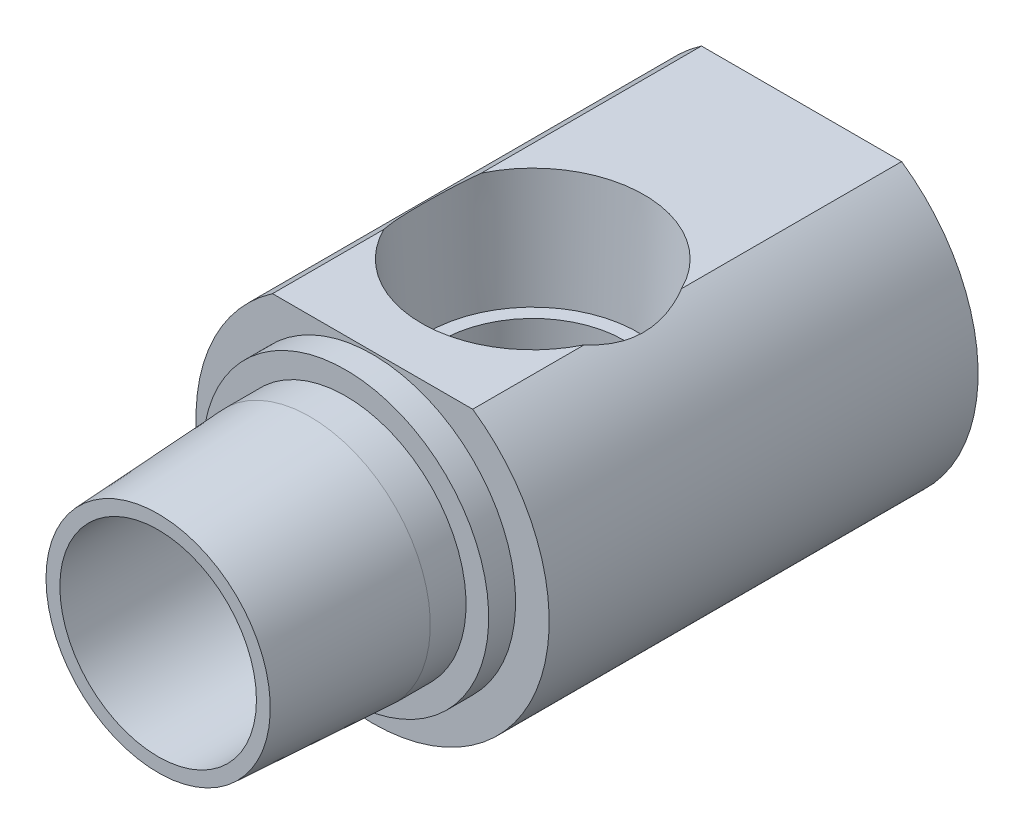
ISO-10303-21;
HEADER;
FILE_DESCRIPTION(('STEP AP214'),'2;1');
FILE_NAME('part.step','',(''),(''),'','','');
FILE_SCHEMA(('AUTOMOTIVE_DESIGN { 1 0 10303 214 1 1 1 1 }'));
ENDSEC;
DATA;
#1=APPLICATION_CONTEXT('core data for automotive mechanical design processes');
#2=APPLICATION_PROTOCOL_DEFINITION('international standard','automotive_design',2000,#1);
#3=PRODUCT_CONTEXT('',#1,'mechanical');
#4=PRODUCT('Part','Part','',(#3));
#5=PRODUCT_RELATED_PRODUCT_CATEGORY('part','',(#4));
#6=PRODUCT_DEFINITION_FORMATION('','',#4);
#7=PRODUCT_DEFINITION_CONTEXT('part definition',#1,'design');
#8=PRODUCT_DEFINITION('design','',#6,#7);
#9=PRODUCT_DEFINITION_SHAPE('','',#8);
#10=(LENGTH_UNIT() NAMED_UNIT(*) SI_UNIT(.MILLI.,.METRE.));
#11=(NAMED_UNIT(*) PLANE_ANGLE_UNIT() SI_UNIT($,.RADIAN.));
#12=(NAMED_UNIT(*) SI_UNIT($,.STERADIAN.) SOLID_ANGLE_UNIT());
#13=UNCERTAINTY_MEASURE_WITH_UNIT(LENGTH_MEASURE(1.E-05),#10,'distance_accuracy_value','');
#14=(GEOMETRIC_REPRESENTATION_CONTEXT(3) GLOBAL_UNCERTAINTY_ASSIGNED_CONTEXT((#13)) GLOBAL_UNIT_ASSIGNED_CONTEXT((#10,
#11,#12)) REPRESENTATION_CONTEXT('',''));
#15=CARTESIAN_POINT('',(0.,0.,0.));
#16=DIRECTION('',(0.,0.,1.));
#17=DIRECTION('',(1.,0.,0.));
#18=AXIS2_PLACEMENT_3D('',#15,#16,#17);
#19=CARTESIAN_POINT('',(-8.89,12.9217429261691,0.));
#20=DIRECTION('',(0.,-1.,0.));
#21=DIRECTION('',(0.,0.,-1.));
#22=AXIS2_PLACEMENT_3D('',#19,#20,#21);
#23=PLANE('',#22);
#24=DIRECTION('',(0.,0.,-1.));
#25=VECTOR('',#24,1.);
#26=CARTESIAN_POINT('',(8.89,12.9217429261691,0.));
#27=LINE('',#26,#25);
#28=CARTESIAN_POINT('',(8.89,12.9217429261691,-19.05));
#29=VERTEX_POINT('',#28);
#30=CARTESIAN_POINT('',(8.89,12.9217429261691,-28.9480549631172));
#31=VERTEX_POINT('',#30);
#32=EDGE_CURVE('E132',#29,#31,#27,.T.);
#33=ORIENTED_EDGE('',*,*,#32,.T.);
#34=CARTESIAN_POINT('',(0.,12.9217429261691,-33.274));
#35=DIRECTION('',(0.,-1.,0.));
#36=DIRECTION('',(0.,0.,-1.));
#37=AXIS2_PLACEMENT_3D('',#34,#35,#36);
#38=CIRCLE('',#37,9.88665264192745);
#39=CARTESIAN_POINT('',(-8.89,12.9217429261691,-28.9480549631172));
#40=VERTEX_POINT('',#39);
#41=EDGE_CURVE('E116',#31,#40,#38,.T.);
#42=ORIENTED_EDGE('',*,*,#41,.T.);
#43=DIRECTION('',(0.,0.,-1.));
#44=VECTOR('',#43,1.);
#45=CARTESIAN_POINT('',(-8.89,12.9217429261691,0.));
#46=LINE('',#45,#44);
#47=CARTESIAN_POINT('',(-8.89,12.9217429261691,-19.05));
#48=VERTEX_POINT('',#47);
#49=EDGE_CURVE('E142',#48,#40,#46,.T.);
#50=ORIENTED_EDGE('',*,*,#49,.F.);
#51=DIRECTION('',(1.,0.,0.));
#52=VECTOR('',#51,1.);
#53=CARTESIAN_POINT('',(-12.7,12.9217429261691,-19.05));
#54=LINE('',#53,#52);
#55=EDGE_CURVE('E139',#48,#29,#54,.T.);
#56=ORIENTED_EDGE('',*,*,#55,.T.);
#57=EDGE_LOOP('',(#33,#42,#50,#56));
#58=FACE_BOUND('',#57,.T.);
#59=ADVANCED_FACE('F16',(#58),#23,.F.);
#60=CARTESIAN_POINT('',(-8.73125000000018,0.,-17.0777962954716));
#61=DIRECTION('',(0.,0.,1.));
#62=DIRECTION('',(1.,0.,0.));
#63=AXIS2_PLACEMENT_3D('',#60,#61,#62);
#64=PLANE('',#63);
#65=CARTESIAN_POINT('',(0.,0.,-17.0777962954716));
#66=DIRECTION('',(0.,0.,-1.));
#67=DIRECTION('',(-1.,0.,0.));
#68=AXIS2_PLACEMENT_3D('',#65,#66,#67);
#69=CIRCLE('',#68,8.73125000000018);
#70=CARTESIAN_POINT('',(-8.73125000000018,0.,-17.0777962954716));
#71=VERTEX_POINT('',#70);
#72=EDGE_CURVE('E164',#71,#71,#69,.T.);
#73=ORIENTED_EDGE('',*,*,#72,.F.);
#74=EDGE_LOOP('',(#73));
#75=FACE_BOUND('',#74,.T.);
#76=CARTESIAN_POINT('',(0.,-1.53831558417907,-17.0777962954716));
#77=DIRECTION('',(0.,0.,1.));
#78=DIRECTION('',(0.,1.,0.));
#79=AXIS2_PLACEMENT_3D('',#76,#77,#78);
#80=ELLIPSE('',#79,7.0682508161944,6.80767250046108);
#81=CARTESIAN_POINT('',(0.,5.52993523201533,-17.0777962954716));
#82=VERTEX_POINT('',#81);
#83=EDGE_CURVE('E175',#82,#82,#80,.F.);
#84=ORIENTED_EDGE('',*,*,#83,.T.);
#85=EDGE_LOOP('',(#84));
#86=FACE_BOUND('',#85,.T.);
#87=ADVANCED_FACE('F220',(#75,#86),#64,.T.);
#88=CARTESIAN_POINT('',(0.,0.,-13.4874));
#89=DIRECTION('',(0.,0.,-1.));
#90=DIRECTION('',(-1.,0.,0.));
#91=AXIS2_PLACEMENT_3D('',#88,#89,#90);
#92=CONICAL_SURFACE('',#91,10.6883167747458,0.0538619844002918);
#93=CARTESIAN_POINT('',(0.,0.,0.));
#94=DIRECTION('',(0.,0.,-1.));
#95=DIRECTION('',(-1.,0.,0.));
#96=AXIS2_PLACEMENT_3D('',#93,#94,#95);
#97=CIRCLE('',#96,9.96115531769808);
#98=CARTESIAN_POINT('',(-9.96115531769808,0.,0.));
#99=VERTEX_POINT('',#98);
#100=EDGE_CURVE('E170',#99,#99,#97,.T.);
#101=ORIENTED_EDGE('',*,*,#100,.T.);
#102=EDGE_LOOP('',(#101));
#103=FACE_BOUND('',#102,.T.);
#104=CARTESIAN_POINT('',(0.,0.,-13.4874));
#105=DIRECTION('',(0.,0.,-1.));
#106=DIRECTION('',(-1.,0.,0.));
#107=AXIS2_PLACEMENT_3D('',#104,#105,#106);
#108=CIRCLE('',#107,10.6883167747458);
#109=CARTESIAN_POINT('',(-10.6883167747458,0.,-13.4874));
#110=VERTEX_POINT('',#109);
#111=EDGE_CURVE('E147',#110,#110,#108,.T.);
#112=ORIENTED_EDGE('',*,*,#111,.F.);
#113=EDGE_LOOP('',(#112));
#114=FACE_BOUND('',#113,.T.);
#115=ADVANCED_FACE('F18',(#103,#114),#92,.T.);
#116=CARTESIAN_POINT('',(-8.73125000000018,0.,0.));
#117=DIRECTION('',(0.,0.,1.));
#118=DIRECTION('',(1.,0.,0.));
#119=AXIS2_PLACEMENT_3D('',#116,#117,#118);
#120=PLANE('',#119);
#121=CARTESIAN_POINT('',(0.,0.,0.));
#122=DIRECTION('',(0.,0.,-1.));
#123=DIRECTION('',(-1.,0.,0.));
#124=AXIS2_PLACEMENT_3D('',#121,#122,#123);
#125=CIRCLE('',#124,8.73125000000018);
#126=CARTESIAN_POINT('',(-8.73125000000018,0.,0.));
#127=VERTEX_POINT('',#126);
#128=EDGE_CURVE('E167',#127,#127,#125,.T.);
#129=ORIENTED_EDGE('',*,*,#128,.T.);
#130=EDGE_LOOP('',(#129));
#131=FACE_BOUND('',#130,.T.);
#132=ORIENTED_EDGE('',*,*,#100,.F.);
#133=EDGE_LOOP('',(#132));
#134=FACE_BOUND('',#133,.T.);
#135=ADVANCED_FACE('F225',(#131,#134),#120,.T.);
#136=CARTESIAN_POINT('',(0.,0.,-75.1971669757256));
#137=DIRECTION('',(0.,0.,-1.));
#138=DIRECTION('',(-1.,0.,0.));
#139=AXIS2_PLACEMENT_3D('',#136,#137,#138);
#140=CYLINDRICAL_SURFACE('',#139,8.73125000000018);
#141=ORIENTED_EDGE('',*,*,#72,.T.);
#142=EDGE_LOOP('',(#141));
#143=FACE_BOUND('',#142,.T.);
#144=ORIENTED_EDGE('',*,*,#128,.F.);
#145=EDGE_LOOP('',(#144));
#146=FACE_BOUND('',#145,.T.);
#147=ADVANCED_FACE('F218',(#143,#146),#140,.F.);
#148=CARTESIAN_POINT('',(-15.6845,0.,-57.15));
#149=DIRECTION('',(0.,0.,-1.));
#150=DIRECTION('',(-1.,0.,0.));
#151=AXIS2_PLACEMENT_3D('',#148,#149,#150);
#152=PLANE('',#151);
#153=DIRECTION('',(1.,0.,0.));
#154=VECTOR('',#153,1.);
#155=CARTESIAN_POINT('',(-3.66617420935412,6.35,-57.15));
#156=LINE('',#155,#154);
#157=CARTESIAN_POINT('',(-3.66617420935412,6.35,-57.15));
#158=VERTEX_POINT('',#157);
#159=CARTESIAN_POINT('',(3.66617420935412,6.35,-57.15));
#160=VERTEX_POINT('',#159);
#161=EDGE_CURVE('E178',#158,#160,#156,.T.);
#162=ORIENTED_EDGE('',*,*,#161,.F.);
#163=DIRECTION('',(0.5,0.866025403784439,0.));
#164=VECTOR('',#163,1.);
#165=CARTESIAN_POINT('',(-7.33234841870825,0.,-57.15));
#166=LINE('',#165,#164);
#167=CARTESIAN_POINT('',(-7.33234841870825,0.,-57.15));
#168=VERTEX_POINT('',#167);
#169=EDGE_CURVE('E435',#168,#158,#166,.T.);
#170=ORIENTED_EDGE('',*,*,#169,.F.);
#171=DIRECTION('',(-0.5,0.866025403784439,0.));
#172=VECTOR('',#171,1.);
#173=CARTESIAN_POINT('',(-3.66617420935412,-6.35,-57.15));
#174=LINE('',#173,#172);
#175=CARTESIAN_POINT('',(-3.66617420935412,-6.35,-57.15));
#176=VERTEX_POINT('',#175);
#177=EDGE_CURVE('E461',#176,#168,#174,.T.);
#178=ORIENTED_EDGE('',*,*,#177,.F.);
#179=DIRECTION('',(-1.,0.,0.));
#180=VECTOR('',#179,1.);
#181=CARTESIAN_POINT('',(3.66617420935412,-6.35,-57.15));
#182=LINE('',#181,#180);
#183=CARTESIAN_POINT('',(3.66617420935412,-6.35,-57.15));
#184=VERTEX_POINT('',#183);
#185=EDGE_CURVE('E458',#184,#176,#182,.T.);
#186=ORIENTED_EDGE('',*,*,#185,.F.);
#187=DIRECTION('',(-0.5,-0.866025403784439,0.));
#188=VECTOR('',#187,1.);
#189=CARTESIAN_POINT('',(7.33234841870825,0.,-57.15));
#190=LINE('',#189,#188);
#191=CARTESIAN_POINT('',(7.33234841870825,0.,-57.15));
#192=VERTEX_POINT('',#191);
#193=EDGE_CURVE('E455',#192,#184,#190,.T.);
#194=ORIENTED_EDGE('',*,*,#193,.F.);
#195=DIRECTION('',(0.5,-0.866025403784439,0.));
#196=VECTOR('',#195,1.);
#197=CARTESIAN_POINT('',(3.66617420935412,6.35,-57.15));
#198=LINE('',#197,#196);
#199=EDGE_CURVE('E452',#160,#192,#198,.T.);
#200=ORIENTED_EDGE('',*,*,#199,.F.);
#201=EDGE_LOOP('',(#162,#170,#178,#186,#194,#200));
#202=FACE_BOUND('',#201,.T.);
#203=DIRECTION('',(-1.,0.,0.));
#204=VECTOR('',#203,1.);
#205=CARTESIAN_POINT('',(-8.89,12.9217429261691,-57.15));
#206=LINE('',#205,#204);
#207=CARTESIAN_POINT('',(8.89,12.9217429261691,-57.15));
#208=VERTEX_POINT('',#207);
#209=CARTESIAN_POINT('',(-8.89,12.9217429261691,-57.15));
#210=VERTEX_POINT('',#209);
#211=EDGE_CURVE('E144',#208,#210,#206,.T.);
#212=ORIENTED_EDGE('',*,*,#211,.F.);
#213=CARTESIAN_POINT('',(0.,0.,-57.15));
#214=DIRECTION('',(0.,0.,-1.));
#215=DIRECTION('',(-1.,0.,0.));
#216=AXIS2_PLACEMENT_3D('',#213,#214,#215);
#217=CIRCLE('',#216,15.6845);
#218=EDGE_CURVE('E161',#208,#210,#217,.T.);
#219=ORIENTED_EDGE('',*,*,#218,.T.);
#220=EDGE_LOOP('',(#212,#219));
#221=FACE_BOUND('',#220,.T.);
#222=ADVANCED_FACE('F213',(#202,#221),#152,.T.);
#223=CARTESIAN_POINT('',(0.,0.,-75.1971669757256));
#224=DIRECTION('',(0.,0.,-1.));
#225=DIRECTION('',(-1.,0.,0.));
#226=AXIS2_PLACEMENT_3D('',#223,#224,#225);
#227=CYLINDRICAL_SURFACE('',#226,15.6845);
#228=CARTESIAN_POINT('',(6.18126199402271,14.4151149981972,-25.4578903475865));
#229=CARTESIAN_POINT('',(6.40820210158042,14.317827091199,-25.6438923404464));
#230=CARTESIAN_POINT('',(6.62617183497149,14.2179923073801,-25.8394298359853));
#231=CARTESIAN_POINT('',(7.04356392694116,14.015896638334,-26.248561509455));
#232=CARTESIAN_POINT('',(7.24297338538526,13.9136341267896,-26.4621680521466));
#233=CARTESIAN_POINT('',(7.62085258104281,13.7102837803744,-26.9044425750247));
#234=CARTESIAN_POINT('',(7.79947267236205,13.6091929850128,-27.1329809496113));
#235=CARTESIAN_POINT('',(8.13667540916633,13.4103063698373,-27.605534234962));
#236=CARTESIAN_POINT('',(8.29527210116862,13.3125082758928,-27.8495381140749));
#237=CARTESIAN_POINT('',(8.52405372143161,13.166366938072,-28.237604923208));
#238=CARTESIAN_POINT('',(8.6015950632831,13.1157948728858,-28.3765443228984));
#239=CARTESIAN_POINT('',(8.75042416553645,13.0169736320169,-28.6587897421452));
#240=CARTESIAN_POINT('',(8.82170394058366,12.9687274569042,-28.8021010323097));
#241=CARTESIAN_POINT('',(8.98942344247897,12.85334420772,-29.160530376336));
#242=CARTESIAN_POINT('',(9.082097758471,12.7878879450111,-29.377972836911));
#243=CARTESIAN_POINT('',(9.25265845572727,12.6650269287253,-29.8207919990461));
#244=CARTESIAN_POINT('',(9.33054529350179,12.6076219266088,-30.046168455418));
#245=CARTESIAN_POINT('',(9.47086217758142,12.5025600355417,-30.5041364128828));
#246=CARTESIAN_POINT('',(9.5332799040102,12.4549109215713,-30.7367334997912));
#247=CARTESIAN_POINT('',(9.64181076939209,12.3710847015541,-31.2076218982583));
#248=CARTESIAN_POINT('',(9.68793245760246,12.3349015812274,-31.445910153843));
#249=CARTESIAN_POINT('',(9.76349281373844,12.2751820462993,-31.9282043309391));
#250=CARTESIAN_POINT('',(9.79282896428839,12.2517233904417,-32.1722361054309));
#251=CARTESIAN_POINT('',(9.83390591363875,12.2187780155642,-32.662731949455));
#252=CARTESIAN_POINT('',(9.84564637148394,12.2092915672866,-32.9091960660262));
#253=CARTESIAN_POINT('',(9.85132494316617,12.2047101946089,-33.4024609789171));
#254=CARTESIAN_POINT('',(9.84526326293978,12.2096151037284,-33.6492617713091));
#255=CARTESIAN_POINT('',(9.81544491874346,12.233598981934,-34.1410778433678));
#256=CARTESIAN_POINT('',(9.79168936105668,12.2526770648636,-34.386093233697));
#257=CARTESIAN_POINT('',(9.7294701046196,12.3021291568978,-34.8530070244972));
#258=CARTESIAN_POINT('',(9.69232783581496,12.3314830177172,-35.0751929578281));
#259=CARTESIAN_POINT('',(9.60385268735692,12.400512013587,-35.5151815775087));
#260=CARTESIAN_POINT('',(9.55251354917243,12.4401917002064,-35.7329822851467));
#261=CARTESIAN_POINT('',(9.43631194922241,12.5285621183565,-36.1626605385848));
#262=CARTESIAN_POINT('',(9.37147123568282,12.5772383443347,-36.3745469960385));
#263=CARTESIAN_POINT('',(9.22879623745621,12.6822986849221,-36.7919366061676));
#264=CARTESIAN_POINT('',(9.15096192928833,12.7386828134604,-36.9974397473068));
#265=CARTESIAN_POINT('',(9.01061877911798,12.838109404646,-37.3347261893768));
#266=CARTESIAN_POINT('',(8.95152353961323,12.8794177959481,-37.4684665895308));
#267=CARTESIAN_POINT('',(8.76461266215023,13.0080031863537,-37.8679033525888));
#268=CARTESIAN_POINT('',(8.62838014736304,13.0990466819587,-38.1285210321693));
#269=CARTESIAN_POINT('',(8.33484719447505,13.2877507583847,-38.6351224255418));
#270=CARTESIAN_POINT('',(8.17753852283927,13.3854139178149,-38.8811003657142));
#271=CARTESIAN_POINT('',(7.8423843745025,13.5844995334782,-39.3580815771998));
#272=CARTESIAN_POINT('',(7.66448703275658,13.685931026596,-39.5890446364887));
#273=CARTESIAN_POINT('',(7.28939666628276,13.8893391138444,-40.034214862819));
#274=CARTESIAN_POINT('',(7.09221474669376,13.9913153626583,-40.2484315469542));
#275=CARTESIAN_POINT('',(6.68803601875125,14.1888008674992,-40.6503950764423));
#276=CARTESIAN_POINT('',(6.48182024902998,14.2844001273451,-40.8388823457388));
#277=CARTESIAN_POINT('',(6.05384699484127,14.4709681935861,-41.1977896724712));
#278=CARTESIAN_POINT('',(5.83215453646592,14.5619538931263,-41.3682785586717));
#279=CARTESIAN_POINT('',(5.60267382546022,14.6496957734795,-41.529590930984));
#280=B_SPLINE_CURVE_WITH_KNOTS('',3,(#228,#229,#230,#231,#232,#233,#234,#235,#236,#237,#238,
#239,#240,#241,#242,#243,#244,#245,#246,#247,#248,#249,#250,#251,#252,#253,#254,#255,#256,#257,
#258,#259,#260,#261,#262,#263,#264,#265,#266,#267,#268,#269,#270,#271,#272,#273,#274,#275,#276,
#277,#278,#279),.UNSPECIFIED.,.F.,.F.,(4,2,2,2,2,2,2,2,2,2,2,2,2,2,2,2,2,2,2,2,2,2,2,2,2,4),(0.,
0.927053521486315,1.85474664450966,2.77524763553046,3.69509925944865,4.19580328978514,
4.69713686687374,5.43222687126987,6.16729417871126,6.90294503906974,7.63820938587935,
8.37791768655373,9.11764032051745,9.85735439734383,10.5970222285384,11.2778067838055,
11.9588919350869,12.6388883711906,13.3188860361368,13.7745816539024,14.6967959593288,
15.6193715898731,16.5443240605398,17.4687469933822,18.3536130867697,19.2349623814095),.UNSPECIFIED.);
#281=CARTESIAN_POINT('',(8.89,12.9217429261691,-37.5999450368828));
#282=VERTEX_POINT('',#281);
#283=EDGE_CURVE('E36',#31,#282,#280,.T.);
#284=ORIENTED_EDGE('',*,*,#283,.F.);
#285=ORIENTED_EDGE('',*,*,#32,.F.);
#286=CARTESIAN_POINT('',(0.,0.,-19.05));
#287=DIRECTION('',(0.,0.,-1.));
#288=DIRECTION('',(-1.,0.,0.));
#289=AXIS2_PLACEMENT_3D('',#286,#287,#288);
#290=CIRCLE('',#289,15.6845);
#291=EDGE_CURVE('E159',#29,#48,#290,.T.);
#292=ORIENTED_EDGE('',*,*,#291,.T.);
#293=ORIENTED_EDGE('',*,*,#49,.T.);
#294=CARTESIAN_POINT('',(-5.60267382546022,14.6496957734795,-41.529590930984));
#295=CARTESIAN_POINT('',(-5.83916916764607,14.5592741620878,-41.3633464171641));
#296=CARTESIAN_POINT('',(-6.06739391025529,14.4654038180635,-41.1873565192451));
#297=CARTESIAN_POINT('',(-6.50657666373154,14.2732361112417,-40.8171061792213));
#298=CARTESIAN_POINT('',(-6.71753229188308,14.1749381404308,-40.6228432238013));
#299=CARTESIAN_POINT('',(-7.12045557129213,13.9768691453,-40.21824748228));
#300=CARTESIAN_POINT('',(-7.31250621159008,13.8771069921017,-40.0079928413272));
#301=CARTESIAN_POINT('',(-7.67797599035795,13.6782845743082,-39.5717033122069));
#302=CARTESIAN_POINT('',(-7.85140185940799,13.5792240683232,-39.3456741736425));
#303=CARTESIAN_POINT('',(-8.18139016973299,13.3830412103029,-38.8751731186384));
#304=CARTESIAN_POINT('',(-8.33766306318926,13.2859696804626,-38.6304767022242));
#305=CARTESIAN_POINT('',(-8.62954581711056,13.0982677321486,-38.1262921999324));
#306=CARTESIAN_POINT('',(-8.76513502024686,13.0076438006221,-37.8667896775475));
#307=CARTESIAN_POINT('',(-8.98947377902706,12.8533099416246,-37.387363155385));
#308=CARTESIAN_POINT('',(-9.0821738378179,12.7878343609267,-37.1698495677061));
#309=CARTESIAN_POINT('',(-9.25276992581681,12.6649454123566,-36.726898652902));
#310=CARTESIAN_POINT('',(-9.33066889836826,12.6075304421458,-36.501462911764));
#311=CARTESIAN_POINT('',(-9.47096094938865,12.5024850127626,-36.043506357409));
#312=CARTESIAN_POINT('',(-9.53335030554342,12.4548569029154,-35.81098385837));
#313=CARTESIAN_POINT('',(-9.64183755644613,12.3710636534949,-35.3402390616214));
#314=CARTESIAN_POINT('',(-9.68794342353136,12.3348929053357,-35.1020196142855));
#315=CARTESIAN_POINT('',(-9.76349062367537,12.2751837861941,-34.6198098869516));
#316=CARTESIAN_POINT('',(-9.79282550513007,12.2517261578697,-34.3757927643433));
#317=CARTESIAN_POINT('',(-9.83390185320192,12.2187812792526,-33.8853289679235));
#318=CARTESIAN_POINT('',(-9.84564316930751,12.2092941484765,-33.6388822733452));
#319=CARTESIAN_POINT('',(-9.85132631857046,12.2047090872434,-33.1456193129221));
#320=CARTESIAN_POINT('',(-9.84526600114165,12.2096128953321,-32.8988030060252));
#321=CARTESIAN_POINT('',(-9.81544809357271,12.2335964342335,-32.4069549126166));
#322=CARTESIAN_POINT('',(-9.79169153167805,12.2526753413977,-32.1619230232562));
#323=CARTESIAN_POINT('',(-9.72947134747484,12.3021281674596,-31.6950023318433));
#324=CARTESIAN_POINT('',(-9.69233092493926,12.3314805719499,-31.4728256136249));
#325=CARTESIAN_POINT('',(-9.60386128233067,12.4005053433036,-31.0328579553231));
#326=CARTESIAN_POINT('',(-9.55252598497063,12.4401821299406,-30.8150689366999));
#327=CARTESIAN_POINT('',(-9.43632738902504,12.5285504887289,-30.3853913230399));
#328=CARTESIAN_POINT('',(-9.37148448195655,12.5772284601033,-30.1734943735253));
#329=CARTESIAN_POINT('',(-9.22880457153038,12.6822926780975,-29.7560851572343));
#330=CARTESIAN_POINT('',(-9.1509674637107,12.7386789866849,-29.5505729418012));
#331=CARTESIAN_POINT('',(-9.01061796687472,12.8381099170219,-29.2132722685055));
#332=CARTESIAN_POINT('',(-8.95152097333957,12.8794194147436,-29.0795285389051));
#333=CARTESIAN_POINT('',(-8.80068775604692,12.9831855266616,-28.7571898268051));
#334=CARTESIAN_POINT('',(-8.70603543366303,13.0469462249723,-28.5703660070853));
#335=CARTESIAN_POINT('',(-8.50583150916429,13.1783430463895,-28.2038453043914));
#336=CARTESIAN_POINT('',(-8.40026939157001,13.2459828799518,-28.0241555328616));
#337=CARTESIAN_POINT('',(-8.14693598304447,13.403699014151,-27.6220187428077));
#338=CARTESIAN_POINT('',(-7.99573471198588,13.4946529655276,-27.402065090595));
#339=CARTESIAN_POINT('',(-7.67663330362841,13.6786987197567,-26.9754150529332));
#340=CARTESIAN_POINT('',(-7.50872479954,13.7717915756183,-26.7687253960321));
#341=CARTESIAN_POINT('',(-7.15655125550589,13.9580450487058,-26.3691064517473));
#342=CARTESIAN_POINT('',(-6.97225920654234,14.0512055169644,-26.176200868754));
#343=CARTESIAN_POINT('',(-6.5882203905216,14.2353204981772,-25.8055123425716));
#344=CARTESIAN_POINT('',(-6.38848080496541,14.3262760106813,-25.6277224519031));
#345=CARTESIAN_POINT('',(-6.18126199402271,14.4151149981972,-25.4578903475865));
#346=B_SPLINE_CURVE_WITH_KNOTS('',3,(#294,#295,#296,#297,#298,#299,#300,#301,#302,#303,#304,
#305,#306,#307,#308,#309,#310,#311,#312,#313,#314,#315,#316,#317,#318,#319,#320,#321,#322,#323,
#324,#325,#326,#327,#328,#329,#330,#331,#332,#333,#334,#335,#336,#337,#338,#339,#340,#341,#342,
#343,#344,#345),.UNSPECIFIED.,.F.,.F.,(4,2,2,2,2,2,2,2,2,2,2,2,2,2,2,2,2,2,2,2,2,2,2,2,2,4),(0.,
0.908274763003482,1.81667463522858,2.7208901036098,3.62477770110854,4.54212421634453,
5.46038099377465,6.19576092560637,6.93099446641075,7.66640429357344,8.40145356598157,
9.14111809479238,9.88078895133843,10.6205491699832,11.3602664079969,12.0410224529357,
12.7220704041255,13.4020975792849,14.0821302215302,14.5378258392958,15.1941212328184,
15.8510552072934,16.6961350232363,17.5416401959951,18.388566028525,19.2351004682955),.UNSPECIFIED.);
#347=CARTESIAN_POINT('',(-8.89,12.9217429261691,-37.5999450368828));
#348=VERTEX_POINT('',#347);
#349=EDGE_CURVE('E120',#348,#40,#346,.T.);
#350=ORIENTED_EDGE('',*,*,#349,.F.);
#351=EDGE_CURVE('E140',#348,#210,#46,.T.);
#352=ORIENTED_EDGE('',*,*,#351,.T.);
#353=ORIENTED_EDGE('',*,*,#218,.F.);
#354=EDGE_CURVE('E135',#282,#208,#27,.T.);
#355=ORIENTED_EDGE('',*,*,#354,.F.);
#356=EDGE_LOOP('',(#284,#285,#292,#293,#350,#352,#353,#355));
#357=FACE_BOUND('',#356,.T.);
#358=ADVANCED_FACE('F130',(#357),#227,.T.);
#359=CARTESIAN_POINT('',(-12.7,0.,-19.05));
#360=DIRECTION('',(0.,0.,1.));
#361=DIRECTION('',(1.,0.,0.));
#362=AXIS2_PLACEMENT_3D('',#359,#360,#361);
#363=PLANE('',#362);
#364=ORIENTED_EDGE('',*,*,#55,.F.);
#365=ORIENTED_EDGE('',*,*,#291,.F.);
#366=EDGE_LOOP('',(#364,#365));
#367=FACE_BOUND('',#366,.T.);
#368=CARTESIAN_POINT('',(0.,0.,-19.05));
#369=DIRECTION('',(0.,0.,-1.));
#370=DIRECTION('',(-1.,0.,0.));
#371=AXIS2_PLACEMENT_3D('',#368,#369,#370);
#372=CIRCLE('',#371,12.7);
#373=CARTESIAN_POINT('',(-12.7,0.,-19.05));
#374=VERTEX_POINT('',#373);
#375=EDGE_CURVE('E156',#374,#374,#372,.T.);
#376=ORIENTED_EDGE('',*,*,#375,.T.);
#377=EDGE_LOOP('',(#376));
#378=FACE_BOUND('',#377,.T.);
#379=ADVANCED_FACE('F212',(#367,#378),#363,.T.);
#380=CARTESIAN_POINT('',(0.,0.,-75.1971669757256));
#381=DIRECTION('',(0.,0.,-1.));
#382=DIRECTION('',(-1.,0.,0.));
#383=AXIS2_PLACEMENT_3D('',#380,#381,#382);
#384=CYLINDRICAL_SURFACE('',#383,12.7);
#385=CARTESIAN_POINT('',(0.,0.,-16.6624));
#386=DIRECTION('',(0.,0.,-1.));
#387=DIRECTION('',(-1.,0.,0.));
#388=AXIS2_PLACEMENT_3D('',#385,#386,#387);
#389=CIRCLE('',#388,12.7);
#390=CARTESIAN_POINT('',(-12.7,0.,-16.6624));
#391=VERTEX_POINT('',#390);
#392=EDGE_CURVE('E153',#391,#391,#389,.T.);
#393=ORIENTED_EDGE('',*,*,#392,.T.);
#394=EDGE_LOOP('',(#393));
#395=FACE_BOUND('',#394,.T.);
#396=ORIENTED_EDGE('',*,*,#375,.F.);
#397=EDGE_LOOP('',(#396));
#398=FACE_BOUND('',#397,.T.);
#399=ADVANCED_FACE('F263',(#395,#398),#384,.T.);
#400=CARTESIAN_POINT('',(-10.6883167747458,0.,-16.6624));
#401=DIRECTION('',(0.,0.,1.));
#402=DIRECTION('',(1.,0.,0.));
#403=AXIS2_PLACEMENT_3D('',#400,#401,#402);
#404=PLANE('',#403);
#405=CARTESIAN_POINT('',(0.,0.,-16.6624));
#406=DIRECTION('',(0.,0.,-1.));
#407=DIRECTION('',(-1.,0.,0.));
#408=AXIS2_PLACEMENT_3D('',#405,#406,#407);
#409=CIRCLE('',#408,10.6883167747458);
#410=CARTESIAN_POINT('',(-10.6883167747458,0.,-16.6624));
#411=VERTEX_POINT('',#410);
#412=EDGE_CURVE('E150',#411,#411,#409,.T.);
#413=ORIENTED_EDGE('',*,*,#412,.T.);
#414=EDGE_LOOP('',(#413));
#415=FACE_BOUND('',#414,.T.);
#416=ORIENTED_EDGE('',*,*,#392,.F.);
#417=EDGE_LOOP('',(#416));
#418=FACE_BOUND('',#417,.T.);
#419=ADVANCED_FACE('F255',(#415,#418),#404,.T.);
#420=CARTESIAN_POINT('',(0.,0.,-75.1971669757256));
#421=DIRECTION('',(0.,0.,-1.));
#422=DIRECTION('',(-1.,0.,0.));
#423=AXIS2_PLACEMENT_3D('',#420,#421,#422);
#424=CYLINDRICAL_SURFACE('',#423,10.6883167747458);
#425=ORIENTED_EDGE('',*,*,#111,.T.);
#426=EDGE_LOOP('',(#425));
#427=FACE_BOUND('',#426,.T.);
#428=ORIENTED_EDGE('',*,*,#412,.F.);
#429=EDGE_LOOP('',(#428));
#430=FACE_BOUND('',#429,.T.);
#431=ADVANCED_FACE('F246',(#427,#430),#424,.T.);
#432=ORIENTED_EDGE('',*,*,#351,.F.);
#433=EDGE_CURVE('E125',#348,#282,#38,.T.);
#434=ORIENTED_EDGE('',*,*,#433,.T.);
#435=ORIENTED_EDGE('',*,*,#354,.T.);
#436=ORIENTED_EDGE('',*,*,#211,.T.);
#437=EDGE_LOOP('',(#432,#434,#435,#436));
#438=FACE_BOUND('',#437,.T.);
#439=ADVANCED_FACE('F238',(#438),#23,.F.);
#440=CARTESIAN_POINT('',(-3.66617420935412,6.35,-50.8));
#441=DIRECTION('',(0.,1.,0.));
#442=DIRECTION('',(-1.,0.,0.));
#443=AXIS2_PLACEMENT_3D('',#440,#441,#442);
#444=PLANE('',#443);
#445=ORIENTED_EDGE('',*,*,#161,.T.);
#446=DIRECTION('',(0.,0.,-1.));
#447=VECTOR('',#446,1.);
#448=CARTESIAN_POINT('',(3.66617420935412,6.35,-50.8));
#449=LINE('',#448,#447);
#450=CARTESIAN_POINT('',(3.66617420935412,6.35,-50.8));
#451=VERTEX_POINT('',#450);
#452=EDGE_CURVE('E450',#451,#160,#449,.T.);
#453=ORIENTED_EDGE('',*,*,#452,.F.);
#454=DIRECTION('',(1.,0.,0.));
#455=VECTOR('',#454,1.);
#456=CARTESIAN_POINT('',(-3.66617420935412,6.35,-50.8));
#457=LINE('',#456,#455);
#458=CARTESIAN_POINT('',(-3.66617420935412,6.35,-50.8));
#459=VERTEX_POINT('',#458);
#460=EDGE_CURVE('E431',#459,#451,#457,.T.);
#461=ORIENTED_EDGE('',*,*,#460,.F.);
#462=DIRECTION('',(0.,0.,-1.));
#463=VECTOR('',#462,1.);
#464=CARTESIAN_POINT('',(-3.66617420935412,6.35,-50.8));
#465=LINE('',#464,#463);
#466=EDGE_CURVE('E466',#459,#158,#465,.T.);
#467=ORIENTED_EDGE('',*,*,#466,.T.);
#468=EDGE_LOOP('',(#445,#453,#461,#467));
#469=FACE_BOUND('',#468,.T.);
#470=ADVANCED_FACE('F245',(#469),#444,.F.);
#471=CARTESIAN_POINT('',(-7.33234841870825,0.,-50.8));
#472=DIRECTION('',(-0.866025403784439,0.5,0.));
#473=DIRECTION('',(-0.5,-0.866025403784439,0.));
#474=AXIS2_PLACEMENT_3D('',#471,#472,#473);
#475=PLANE('',#474);
#476=ORIENTED_EDGE('',*,*,#169,.T.);
#477=ORIENTED_EDGE('',*,*,#466,.F.);
#478=DIRECTION('',(0.5,0.866025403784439,0.));
#479=VECTOR('',#478,1.);
#480=CARTESIAN_POINT('',(-7.33234841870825,0.,-50.8));
#481=LINE('',#480,#479);
#482=CARTESIAN_POINT('',(-7.33234841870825,0.,-50.8));
#483=VERTEX_POINT('',#482);
#484=EDGE_CURVE('E447',#483,#459,#481,.T.);
#485=ORIENTED_EDGE('',*,*,#484,.F.);
#486=DIRECTION('',(0.,0.,-1.));
#487=VECTOR('',#486,1.);
#488=CARTESIAN_POINT('',(-7.33234841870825,0.,-50.8));
#489=LINE('',#488,#487);
#490=EDGE_CURVE('E468',#483,#168,#489,.T.);
#491=ORIENTED_EDGE('',*,*,#490,.T.);
#492=EDGE_LOOP('',(#476,#477,#485,#491));
#493=FACE_BOUND('',#492,.T.);
#494=ADVANCED_FACE('F253',(#493),#475,.F.);
#495=CARTESIAN_POINT('',(-3.66617420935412,-6.35,-50.8));
#496=DIRECTION('',(-0.866025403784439,-0.5,0.));
#497=DIRECTION('',(0.5,-0.866025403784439,0.));
#498=AXIS2_PLACEMENT_3D('',#495,#496,#497);
#499=PLANE('',#498);
#500=ORIENTED_EDGE('',*,*,#177,.T.);
#501=ORIENTED_EDGE('',*,*,#490,.F.);
#502=DIRECTION('',(-0.5,0.866025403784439,0.));
#503=VECTOR('',#502,1.);
#504=CARTESIAN_POINT('',(-3.66617420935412,-6.35,-50.8));
#505=LINE('',#504,#503);
#506=CARTESIAN_POINT('',(-3.66617420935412,-6.35,-50.8));
#507=VERTEX_POINT('',#506);
#508=EDGE_CURVE('E444',#507,#483,#505,.T.);
#509=ORIENTED_EDGE('',*,*,#508,.F.);
#510=DIRECTION('',(0.,0.,-1.));
#511=VECTOR('',#510,1.);
#512=CARTESIAN_POINT('',(-3.66617420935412,-6.35,-50.8));
#513=LINE('',#512,#511);
#514=EDGE_CURVE('E470',#507,#176,#513,.T.);
#515=ORIENTED_EDGE('',*,*,#514,.T.);
#516=EDGE_LOOP('',(#500,#501,#509,#515));
#517=FACE_BOUND('',#516,.T.);
#518=ADVANCED_FACE('F335',(#517),#499,.F.);
#519=CARTESIAN_POINT('',(3.66617420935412,-6.35,-50.8));
#520=DIRECTION('',(0.,-1.,0.));
#521=DIRECTION('',(1.,0.,0.));
#522=AXIS2_PLACEMENT_3D('',#519,#520,#521);
#523=PLANE('',#522);
#524=ORIENTED_EDGE('',*,*,#185,.T.);
#525=ORIENTED_EDGE('',*,*,#514,.F.);
#526=DIRECTION('',(-1.,0.,0.));
#527=VECTOR('',#526,1.);
#528=CARTESIAN_POINT('',(3.66617420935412,-6.35,-50.8));
#529=LINE('',#528,#527);
#530=CARTESIAN_POINT('',(3.66617420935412,-6.35,-50.8));
#531=VERTEX_POINT('',#530);
#532=EDGE_CURVE('E441',#531,#507,#529,.T.);
#533=ORIENTED_EDGE('',*,*,#532,.F.);
#534=DIRECTION('',(0.,0.,-1.));
#535=VECTOR('',#534,1.);
#536=CARTESIAN_POINT('',(3.66617420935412,-6.35,-50.8));
#537=LINE('',#536,#535);
#538=EDGE_CURVE('E472',#531,#184,#537,.T.);
#539=ORIENTED_EDGE('',*,*,#538,.T.);
#540=EDGE_LOOP('',(#524,#525,#533,#539));
#541=FACE_BOUND('',#540,.T.);
#542=ADVANCED_FACE('F329',(#541),#523,.F.);
#543=CARTESIAN_POINT('',(7.33234841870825,0.,-50.8));
#544=DIRECTION('',(0.866025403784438,-0.5,0.));
#545=DIRECTION('',(0.5,0.866025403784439,0.));
#546=AXIS2_PLACEMENT_3D('',#543,#544,#545);
#547=PLANE('',#546);
#548=ORIENTED_EDGE('',*,*,#193,.T.);
#549=ORIENTED_EDGE('',*,*,#538,.F.);
#550=DIRECTION('',(-0.5,-0.866025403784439,0.));
#551=VECTOR('',#550,1.);
#552=CARTESIAN_POINT('',(7.33234841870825,0.,-50.8));
#553=LINE('',#552,#551);
#554=CARTESIAN_POINT('',(7.33234841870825,0.,-50.8));
#555=VERTEX_POINT('',#554);
#556=EDGE_CURVE('E438',#555,#531,#553,.T.);
#557=ORIENTED_EDGE('',*,*,#556,.F.);
#558=DIRECTION('',(0.,0.,-1.));
#559=VECTOR('',#558,1.);
#560=CARTESIAN_POINT('',(7.33234841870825,0.,-50.8));
#561=LINE('',#560,#559);
#562=EDGE_CURVE('E474',#555,#192,#561,.T.);
#563=ORIENTED_EDGE('',*,*,#562,.T.);
#564=EDGE_LOOP('',(#548,#549,#557,#563));
#565=FACE_BOUND('',#564,.T.);
#566=ADVANCED_FACE('F334',(#565),#547,.F.);
#567=CARTESIAN_POINT('',(3.66617420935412,6.35,-50.8));
#568=DIRECTION('',(0.866025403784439,0.5,0.));
#569=DIRECTION('',(-0.5,0.866025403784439,0.));
#570=AXIS2_PLACEMENT_3D('',#567,#568,#569);
#571=PLANE('',#570);
#572=ORIENTED_EDGE('',*,*,#199,.T.);
#573=ORIENTED_EDGE('',*,*,#562,.F.);
#574=DIRECTION('',(0.5,-0.866025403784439,0.));
#575=VECTOR('',#574,1.);
#576=CARTESIAN_POINT('',(3.66617420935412,6.35,-50.8));
#577=LINE('',#576,#575);
#578=EDGE_CURVE('E434',#451,#555,#577,.T.);
#579=ORIENTED_EDGE('',*,*,#578,.F.);
#580=ORIENTED_EDGE('',*,*,#452,.T.);
#581=EDGE_LOOP('',(#572,#573,#579,#580));
#582=FACE_BOUND('',#581,.T.);
#583=ADVANCED_FACE('F347',(#582),#571,.F.);
#584=CARTESIAN_POINT('',(0.,0.,-50.8));
#585=DIRECTION('',(0.,0.,-1.));
#586=DIRECTION('',(-1.,0.,0.));
#587=AXIS2_PLACEMENT_3D('',#584,#585,#586);
#588=PLANE('',#587);
#589=ORIENTED_EDGE('',*,*,#460,.T.);
#590=ORIENTED_EDGE('',*,*,#578,.T.);
#591=ORIENTED_EDGE('',*,*,#556,.T.);
#592=ORIENTED_EDGE('',*,*,#532,.T.);
#593=ORIENTED_EDGE('',*,*,#508,.T.);
#594=ORIENTED_EDGE('',*,*,#484,.T.);
#595=EDGE_LOOP('',(#589,#590,#591,#592,#593,#594));
#596=FACE_BOUND('',#595,.T.);
#597=ADVANCED_FACE('F366',(#596),#588,.T.);
#598=CARTESIAN_POINT('',(0.,-6.16022605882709,-32.9348809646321));
#599=DIRECTION('',(0.,0.267292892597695,0.963615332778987));
#600=DIRECTION('',(0.,-0.963615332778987,0.267292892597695));
#601=AXIS2_PLACEMENT_3D('',#598,#599,#600);
#602=CONICAL_SURFACE('',#601,4.92936747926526,0.794181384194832);
#603=CARTESIAN_POINT('',(-4.92956747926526,-6.70529941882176,-32.7494241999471));
#604=CARTESIAN_POINT('',(-4.86454849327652,-6.74578087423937,-32.8010709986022));
#605=CARTESIAN_POINT('',(-4.79934438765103,-6.78602416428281,-32.8526711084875));
#606=CARTESIAN_POINT('',(-4.66853190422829,-6.86595614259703,-32.955790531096));
#607=CARTESIAN_POINT('',(-4.6029235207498,-6.90564482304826,-33.0073098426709));
#608=CARTESIAN_POINT('',(-4.40534693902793,-7.0238176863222,-33.1618389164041));
#609=CARTESIAN_POINT('',(-4.27272274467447,-7.10134897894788,-33.2647439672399));
#610=CARTESIAN_POINT('',(-4.00251092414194,-7.25460162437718,-33.4727581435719));
#611=CARTESIAN_POINT('',(-3.86487828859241,-7.33024565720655,-33.5778659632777));
#612=CARTESIAN_POINT('',(-3.58724919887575,-7.47631067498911,-33.7885271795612));
#613=CARTESIAN_POINT('',(-3.4472535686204,-7.54673343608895,-33.8940804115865));
#614=CARTESIAN_POINT('',(-3.21819876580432,-7.6544961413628,-34.0666952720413));
#615=CARTESIAN_POINT('',(-3.12989166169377,-7.69427803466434,-34.1332226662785));
#616=CARTESIAN_POINT('',(-2.95246158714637,-7.76968051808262,-34.2675218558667));
#617=CARTESIAN_POINT('',(-2.86333881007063,-7.80530206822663,-34.3352933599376));
#618=CARTESIAN_POINT('',(-2.68510954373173,-7.87069033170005,-34.4725920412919));
#619=CARTESIAN_POINT('',(-2.59600565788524,-7.90048815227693,-34.5421075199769));
#620=CARTESIAN_POINT('',(-2.41819352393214,-7.95229207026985,-34.6845042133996));
#621=CARTESIAN_POINT('',(-2.32948506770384,-7.97430290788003,-34.7573833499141));
#622=CARTESIAN_POINT('',(-2.18125639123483,-8.0025802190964,-34.8847777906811));
#623=CARTESIAN_POINT('',(-2.12117975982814,-8.01160947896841,-34.93801645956));
#624=CARTESIAN_POINT('',(-2.00293406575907,-8.02367996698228,-35.0472285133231));
#625=CARTESIAN_POINT('',(-1.94476433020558,-8.02672333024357,-35.1032009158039));
#626=CARTESIAN_POINT('',(-1.83159633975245,-8.02621720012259,-35.2176935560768));
#627=CARTESIAN_POINT('',(-1.77658330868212,-8.0227015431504,-35.276199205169));
#628=CARTESIAN_POINT('',(-1.6701866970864,-8.00916225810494,-35.3956932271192));
#629=CARTESIAN_POINT('',(-1.61880314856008,-7.99913857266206,-35.4566816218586));
#630=CARTESIAN_POINT('',(-1.50977573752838,-7.97060670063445,-35.5932146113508));
#631=CARTESIAN_POINT('',(-1.45300970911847,-7.95077990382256,-35.6691789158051));
#632=CARTESIAN_POINT('',(-1.34440201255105,-7.9045561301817,-35.8226384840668));
#633=CARTESIAN_POINT('',(-1.29256550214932,-7.87815237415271,-35.9001352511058));
#634=CARTESIAN_POINT('',(-1.19160520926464,-7.82024221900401,-36.056916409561));
#635=CARTESIAN_POINT('',(-1.14254008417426,-7.78865902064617,-36.1362092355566));
#636=CARTESIAN_POINT('',(-1.04637994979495,-7.72237338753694,-36.29448783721));
#637=CARTESIAN_POINT('',(-0.999282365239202,-7.6876752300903,-36.3734738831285));
#638=CARTESIAN_POINT('',(-0.905327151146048,-7.61651127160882,-36.5302968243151));
#639=CARTESIAN_POINT('',(-0.858469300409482,-7.58005286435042,-36.6081369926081));
#640=CARTESIAN_POINT('',(-0.762530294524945,-7.50612620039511,-36.7625501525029));
#641=CARTESIAN_POINT('',(-0.713440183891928,-7.4686541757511,-36.839115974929));
#642=CARTESIAN_POINT('',(-0.636553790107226,-7.41316517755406,-36.9507753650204));
#643=CARTESIAN_POINT('',(-0.610675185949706,-7.39497859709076,-36.98709331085));
#644=CARTESIAN_POINT('',(-0.557166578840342,-7.35895068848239,-37.0585834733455));
#645=CARTESIAN_POINT('',(-0.529537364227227,-7.34110920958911,-37.0937561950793));
#646=CARTESIAN_POINT('',(-0.472002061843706,-7.30624531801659,-37.1621240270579));
#647=CARTESIAN_POINT('',(-0.442114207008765,-7.28921784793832,-37.1953317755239));
#648=CARTESIAN_POINT('',(-0.378876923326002,-7.25646188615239,-37.2589387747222));
#649=CARTESIAN_POINT('',(-0.345537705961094,-7.24072979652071,-37.2893458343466));
#650=CARTESIAN_POINT('',(-0.298590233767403,-7.2217446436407,-37.3259206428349));
#651=CARTESIAN_POINT('',(-0.287212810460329,-7.21736140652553,-37.3343553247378));
#652=CARTESIAN_POINT('',(-0.263920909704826,-7.20889912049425,-37.3506238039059));
#653=CARTESIAN_POINT('',(-0.252006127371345,-7.20482024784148,-37.3584572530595));
#654=CARTESIAN_POINT('',(-0.215431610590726,-7.19316114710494,-37.3808293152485));
#655=CARTESIAN_POINT('',(-0.189883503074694,-7.18613396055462,-37.3942867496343));
#656=CARTESIAN_POINT('',(-0.143911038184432,-7.17602735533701,-37.413620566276));
#657=CARTESIAN_POINT('',(-0.124064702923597,-7.17239348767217,-37.4205646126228));
#658=CARTESIAN_POINT('',(-0.0833496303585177,-7.16666514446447,-37.4315060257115));
#659=CARTESIAN_POINT('',(-0.0624819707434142,-7.16456908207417,-37.4355064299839));
#660=CARTESIAN_POINT('',(-0.0201025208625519,-7.16218209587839,-37.440061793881));
#661=CARTESIAN_POINT('',(0.00141281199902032,-7.16190420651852,-37.4405918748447));
#662=CARTESIAN_POINT('',(0.0441684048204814,-7.16323101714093,-37.438060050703));
#663=CARTESIAN_POINT('',(0.0654085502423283,-7.16483647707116,-37.4349966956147));
#664=CARTESIAN_POINT('',(0.110198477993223,-7.17008198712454,-37.4249806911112));
#665=CARTESIAN_POINT('',(0.133592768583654,-7.17399996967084,-37.4174966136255));
#666=CARTESIAN_POINT('',(0.17873468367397,-7.18350548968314,-37.3993166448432));
#667=CARTESIAN_POINT('',(0.200478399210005,-7.18909684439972,-37.3886134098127));
#668=CARTESIAN_POINT('',(0.2398629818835,-7.20073247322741,-37.366305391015));
#669=CARTESIAN_POINT('',(0.257687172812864,-7.20664892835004,-37.3549492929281));
#670=CARTESIAN_POINT('',(0.292180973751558,-7.21915234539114,-37.3309127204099));
#671=CARTESIAN_POINT('',(0.308849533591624,-7.22573990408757,-37.3182310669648));
#672=CARTESIAN_POINT('',(0.341213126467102,-7.23941653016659,-37.2918562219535));
#673=CARTESIAN_POINT('',(0.356905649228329,-7.24650679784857,-37.2781606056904));
#674=CARTESIAN_POINT('',(0.387415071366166,-7.26104267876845,-37.2500286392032));
#675=CARTESIAN_POINT('',(0.402232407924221,-7.26848811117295,-37.2355926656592));
#676=CARTESIAN_POINT('',(0.445150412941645,-7.29098927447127,-37.1918725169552));
#677=CARTESIAN_POINT('',(0.472204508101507,-7.30642610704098,-37.1617596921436));
#678=CARTESIAN_POINT('',(0.524288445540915,-7.33787585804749,-37.100105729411));
#679=CARTESIAN_POINT('',(0.549316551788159,-7.35388925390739,-37.0685634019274));
#680=CARTESIAN_POINT('',(0.597944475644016,-7.38626125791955,-37.0044323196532));
#681=CARTESIAN_POINT('',(0.621540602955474,-7.40262062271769,-36.9718411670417));
#682=CARTESIAN_POINT('',(0.667647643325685,-7.43546985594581,-36.905961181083));
#683=CARTESIAN_POINT('',(0.690158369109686,-7.45195974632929,-36.8726722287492));
#684=CARTESIAN_POINT('',(0.756929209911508,-7.50170827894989,-36.7714653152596));
#685=CARTESIAN_POINT('',(0.800015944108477,-7.53495851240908,-36.7027736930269));
#686=CARTESIAN_POINT('',(0.884912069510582,-7.60055008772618,-36.5643545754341));
#687=CARTESIAN_POINT('',(0.926723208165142,-7.63289266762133,-36.494628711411));
#688=CARTESIAN_POINT('',(1.01820852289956,-7.70171107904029,-36.3418036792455));
#689=CARTESIAN_POINT('',(1.06792659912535,-7.73786554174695,-36.25858379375));
#690=CARTESIAN_POINT('',(1.16983424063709,-7.80643496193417,-36.0919919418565));
#691=CARTESIAN_POINT('',(1.22202530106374,-7.83884761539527,-36.0086199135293));
#692=CARTESIAN_POINT('',(1.3300168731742,-7.89746710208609,-35.8439498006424));
#693=CARTESIAN_POINT('',(1.38574898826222,-7.92376225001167,-35.762639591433));
#694=CARTESIAN_POINT('',(1.50302343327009,-7.96843195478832,-35.6020644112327));
#695=CARTESIAN_POINT('',(1.56455968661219,-7.98681468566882,-35.5227974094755));
#696=CARTESIAN_POINT('',(1.68274005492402,-8.0113305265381,-35.381030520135));
#697=CARTESIAN_POINT('',(1.73840719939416,-8.01902598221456,-35.3179903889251));
#698=CARTESIAN_POINT('',(1.85342088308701,-8.0271237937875,-35.1948696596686));
#699=CARTESIAN_POINT('',(1.91276752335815,-8.02752594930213,-35.1347891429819));
#700=CARTESIAN_POINT('',(2.03541341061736,-8.02131936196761,-35.0164430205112));
#701=CARTESIAN_POINT('',(2.09877111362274,-8.01455501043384,-34.9582471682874));
#702=CARTESIAN_POINT('',(2.22705927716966,-7.99476920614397,-34.8447606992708));
#703=CARTESIAN_POINT('',(2.29199008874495,-7.98174634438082,-34.789470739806));
#704=CARTESIAN_POINT('',(2.47290620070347,-7.93863392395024,-34.6393754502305));
#705=CARTESIAN_POINT('',(2.5896031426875,-7.90313058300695,-34.5470205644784));
#706=CARTESIAN_POINT('',(2.8225077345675,-7.82171920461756,-34.3662734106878));
#707=CARTESIAN_POINT('',(2.93871435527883,-7.77579524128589,-34.2778874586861));
#708=CARTESIAN_POINT('',(3.17037156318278,-7.67676905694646,-34.1026268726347));
#709=CARTESIAN_POINT('',(3.28581352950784,-7.6236257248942,-34.0157643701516));
#710=CARTESIAN_POINT('',(3.51496782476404,-7.51258701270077,-33.8430158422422));
#711=CARTESIAN_POINT('',(3.62868121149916,-7.45469468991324,-33.7571292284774));
#712=CARTESIAN_POINT('',(3.84346248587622,-7.34132392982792,-33.5940730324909));
#713=CARTESIAN_POINT('',(3.94467760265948,-7.28616486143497,-33.5168739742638));
#714=CARTESIAN_POINT('',(4.14594860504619,-7.17370528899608,-33.3624841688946));
#715=CARTESIAN_POINT('',(4.24600427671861,-7.11640439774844,-33.28529342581));
#716=CARTESIAN_POINT('',(4.44384293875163,-7.00085162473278,-33.1317451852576));
#717=CARTESIAN_POINT('',(4.54163876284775,-6.94261988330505,-33.0553890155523));
#718=CARTESIAN_POINT('',(4.73628082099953,-6.82485933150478,-32.902533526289));
#719=CARTESIAN_POINT('',(4.83312730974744,-6.7653308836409,-32.8260342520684));
#720=CARTESIAN_POINT('',(4.92956747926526,-6.70529941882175,-32.7494241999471));
#721=B_SPLINE_CURVE_WITH_KNOTS('',3,(#603,#604,#605,#606,#607,#608,#609,#610,#611,#612,#613,
#614,#615,#616,#617,#618,#619,#620,#621,#622,#623,#624,#625,#626,#627,#628,#629,#630,#631,#632,
#633,#634,#635,#636,#637,#638,#639,#640,#641,#642,#643,#644,#645,#646,#647,#648,#649,#650,#651,
#652,#653,#654,#655,#656,#657,#658,#659,#660,#661,#662,#663,#664,#665,#666,#667,#668,#669,#670,
#671,#672,#673,#674,#675,#676,#677,#678,#679,#680,#681,#682,#683,#684,#685,#686,#687,#688,#689,
#690,#691,#692,#693,#694,#695,#696,#697,#698,#699,#700,#701,#702,#703,#704,#705,#706,#707,#708,
#709,#710,#711,#712,#713,#714,#715,#716,#717,#718,#719,#720),.UNSPECIFIED.,.F.,.F.,(4,2,2,2,2,2,
2,2,2,2,2,2,2,2,2,2,2,2,2,2,2,2,2,2,2,2,2,2,2,2,2,2,2,2,2,2,2,2,2,2,2,2,2,2,2,2,2,2,2,2,2,2,2,2,
2,2,2,2,4),(0.,0.277131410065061,0.554266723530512,1.10894454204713,1.67582273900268,
2.24250720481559,2.59495486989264,2.94732104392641,3.29775028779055,3.64796584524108,
3.89006351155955,4.13207480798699,4.37284107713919,4.61360946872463,4.90376471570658,
5.19422028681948,5.48945424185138,5.78428882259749,6.07797756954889,6.37297155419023,
6.51742442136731,6.66181269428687,6.80513942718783,6.94805360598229,6.99250734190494,
7.03698662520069,7.12571030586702,7.18949790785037,7.25321959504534,7.31739760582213,
7.38160152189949,7.45580479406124,7.53017864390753,7.59592329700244,7.66172693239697,
7.72769335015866,7.79362653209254,7.92347126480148,8.05342610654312,8.18370275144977,
8.31400179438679,8.57686868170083,8.83935762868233,9.14969866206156,9.46022978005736,
9.76595294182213,10.0713595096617,10.3242750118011,10.5771974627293,10.8357264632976,
11.0943136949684,11.5525549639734,12.0115013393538,12.4731802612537,12.9345642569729,
13.3507361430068,13.7669836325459,14.178151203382,14.5892052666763),.UNSPECIFIED.);
#722=CARTESIAN_POINT('',(-4.89410839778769,-6.72734191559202,-32.7775712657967));
#723=VERTEX_POINT('',#722);
#724=CARTESIAN_POINT('',(4.89410839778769,-6.72734191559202,-32.7775712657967));
#725=VERTEX_POINT('',#724);
#726=EDGE_CURVE('E136',#723,#725,#721,.T.);
#727=ORIENTED_EDGE('',*,*,#726,.F.);
#728=CARTESIAN_POINT('',(0.,-6.16022605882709,-32.9348809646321));
#729=DIRECTION('',(0.,-0.267292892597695,-0.963615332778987));
#730=DIRECTION('',(0.,0.963615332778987,-0.267292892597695));
#731=AXIS2_PLACEMENT_3D('',#728,#729,#730);
#732=CIRCLE('',#731,4.92936747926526);
#733=EDGE_CURVE('E179',#725,#723,#732,.T.);
#734=ORIENTED_EDGE('',*,*,#733,.F.);
#735=EDGE_LOOP('',(#727,#734));
#736=FACE_BOUND('',#735,.T.);
#737=CARTESIAN_POINT('',(0.,-7.45486660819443,-37.6021785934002));
#738=VERTEX_POINT('',#737);
#739=VERTEX_LOOP('',#738);
#740=FACE_BOUND('',#739,.T.);
#741=ADVANCED_FACE('F376',(#736,#740),#602,.F.);
#742=CARTESIAN_POINT('',(0.,-0.374711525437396,-12.0775717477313));
#743=DIRECTION('',(0.,0.267292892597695,0.963615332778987));
#744=DIRECTION('',(0.,-0.963615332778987,0.267292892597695));
#745=AXIS2_PLACEMENT_3D('',#742,#743,#744);
#746=CONICAL_SURFACE('',#745,7.39548661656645,0.113446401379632);
#747=CARTESIAN_POINT('',(4.76098088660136,-6.76122891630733,-34.2526658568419));
#748=CARTESIAN_POINT('',(4.77116683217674,-6.76832025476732,-34.1422369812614));
#749=CARTESIAN_POINT('',(4.78112654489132,-6.77336535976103,-34.0316489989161));
#750=CARTESIAN_POINT('',(4.80084554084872,-6.77917532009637,-33.8103362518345));
#751=CARTESIAN_POINT('',(4.81060481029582,-6.77993988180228,-33.6996114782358));
#752=CARTESIAN_POINT('',(4.83015809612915,-6.77700228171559,-33.4783974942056));
#753=CARTESIAN_POINT('',(4.83995203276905,-6.77330720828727,-33.3679081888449));
#754=CARTESIAN_POINT('',(4.85978391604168,-6.76142678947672,-33.1472034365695));
#755=CARTESIAN_POINT('',(4.86982185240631,-6.75324163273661,-33.0369879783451));
#756=CARTESIAN_POINT('',(4.90026789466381,-6.72230572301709,-32.7099605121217));
#757=CARTESIAN_POINT('',(4.92126224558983,-6.69313187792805,-32.4937827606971));
#758=CARTESIAN_POINT('',(4.96531856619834,-6.61929257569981,-32.0643476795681));
#759=CARTESIAN_POINT('',(4.98838084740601,-6.57462478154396,-31.8510907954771));
#760=CARTESIAN_POINT('',(5.03316421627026,-6.47936742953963,-31.456225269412));
#761=CARTESIAN_POINT('',(5.05465210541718,-6.4303690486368,-31.2741987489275));
#762=CARTESIAN_POINT('',(5.09871537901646,-6.32458689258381,-30.9125374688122));
#763=CARTESIAN_POINT('',(5.12129098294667,-6.26780154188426,-30.7329032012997));
#764=CARTESIAN_POINT('',(5.1672036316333,-6.14793098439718,-30.3755222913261));
#765=CARTESIAN_POINT('',(5.19054190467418,-6.08483524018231,-30.1977793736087));
#766=CARTESIAN_POINT('',(5.23760452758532,-5.95372472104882,-29.8441948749));
#767=CARTESIAN_POINT('',(5.26132885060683,-5.8857102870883,-29.6683531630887));
#768=CARTESIAN_POINT('',(5.30951176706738,-5.74392399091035,-29.3136114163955));
#769=CARTESIAN_POINT('',(5.33397315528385,-5.67004730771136,-29.1347538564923));
#770=CARTESIAN_POINT('',(5.38276331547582,-5.51902669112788,-28.7784008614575));
#771=CARTESIAN_POINT('',(5.40709208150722,-5.44188261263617,-28.6009054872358));
#772=CARTESIAN_POINT('',(5.45531585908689,-5.28534639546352,-28.2478439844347));
#773=CARTESIAN_POINT('',(5.47921234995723,-5.2059662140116,-28.0722727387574));
#774=CARTESIAN_POINT('',(5.52655057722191,-5.04510152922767,-27.7220667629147));
#775=CARTESIAN_POINT('',(5.54999238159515,-4.96361734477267,-27.5474318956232));
#776=CARTESIAN_POINT('',(5.57314297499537,-4.88130922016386,-27.3731540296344));
#777=B_SPLINE_CURVE_WITH_KNOTS('',3,(#747,#748,#749,#750,#751,#752,#753,#754,#755,#756,#757,
#758,#759,#760,#761,#762,#763,#764,#765,#766,#767,#768,#769,#770,#771,#772,#773,#774,#775,#776),
.UNSPECIFIED.,.F.,.F.,(4,2,2,2,2,2,2,2,2,2,2,2,2,2,4),(0.,0.333363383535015,0.666749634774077,
0.999606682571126,1.33244974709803,1.98917542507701,2.646000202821,3.21497186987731,
3.78405882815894,4.35411246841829,4.92412663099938,5.5092494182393,6.09439821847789,
6.67685854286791,7.25923110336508),.UNSPECIFIED.);
#778=CARTESIAN_POINT('',(5.57308671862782,-4.88150922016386,-27.3735773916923));
#779=VERTEX_POINT('',#778);
#780=EDGE_CURVE('E10',#725,#779,#777,.T.);
#781=ORIENTED_EDGE('',*,*,#780,.F.);
#782=ORIENTED_EDGE('',*,*,#733,.T.);
#783=CARTESIAN_POINT('',(-5.57314297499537,-4.88130922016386,-27.3731540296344));
#784=CARTESIAN_POINT('',(-5.54864798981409,-4.96839763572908,-27.5575641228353));
#785=CARTESIAN_POINT('',(-5.52382511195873,-5.05456937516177,-27.7423720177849));
#786=CARTESIAN_POINT('',(-5.47367787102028,-5.22453041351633,-28.1130546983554));
#787=CARTESIAN_POINT('',(-5.44835341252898,-5.30831925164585,-28.2989296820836));
#788=CARTESIAN_POINT('',(-5.39720632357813,-5.47344975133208,-28.6731215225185));
#789=CARTESIAN_POINT('',(-5.37138156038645,-5.55477268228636,-28.861446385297));
#790=CARTESIAN_POINT('',(-5.31962582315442,-5.71359939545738,-29.2396795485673));
#791=CARTESIAN_POINT('',(-5.29369485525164,-5.79110339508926,-29.4295877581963));
#792=CARTESIAN_POINT('',(-5.24277644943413,-5.93906110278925,-29.805846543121));
#793=CARTESIAN_POINT('',(-5.21778339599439,-6.00965380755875,-29.9921413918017));
#794=CARTESIAN_POINT('',(-5.16833391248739,-6.14495538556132,-30.3669635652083));
#795=CARTESIAN_POINT('',(-5.14387753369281,-6.20966369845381,-30.5554911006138));
#796=CARTESIAN_POINT('',(-5.0959765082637,-6.33139627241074,-30.9346420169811));
#797=CARTESIAN_POINT('',(-5.07252951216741,-6.38843911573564,-31.1252590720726));
#798=CARTESIAN_POINT('',(-5.0270098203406,-6.49303667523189,-31.5092164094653));
#799=CARTESIAN_POINT('',(-5.00493671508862,-6.54059422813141,-31.7025558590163));
#800=CARTESIAN_POINT('',(-4.96280295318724,-6.62342077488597,-32.0888184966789));
#801=CARTESIAN_POINT('',(-4.94271568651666,-6.6588747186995,-32.2816985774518));
#802=CARTESIAN_POINT('',(-4.90415121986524,-6.71669386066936,-32.6696488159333));
#803=CARTESIAN_POINT('',(-4.88567425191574,-6.73905717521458,-32.8647192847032));
#804=CARTESIAN_POINT('',(-4.85867174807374,-6.76210080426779,-33.1594515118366));
#805=CARTESIAN_POINT('',(-4.84973521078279,-6.76803526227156,-33.2586883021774));
#806=CARTESIAN_POINT('',(-4.83201463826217,-6.77627351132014,-33.4573335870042));
#807=CARTESIAN_POINT('',(-4.82323060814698,-6.77857718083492,-33.5567420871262));
#808=CARTESIAN_POINT('',(-4.80565778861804,-6.77960294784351,-33.7556541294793));
#809=CARTESIAN_POINT('',(-4.79686900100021,-6.77832218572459,-33.8551576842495));
#810=CARTESIAN_POINT('',(-4.77910860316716,-6.7723195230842,-34.0540385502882));
#811=CARTESIAN_POINT('',(-4.77013700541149,-6.76759785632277,-34.1534158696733));
#812=CARTESIAN_POINT('',(-4.76098088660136,-6.76122891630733,-34.2526658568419));
#813=B_SPLINE_CURVE_WITH_KNOTS('',3,(#783,#784,#785,#786,#787,#788,#789,#790,#791,#792,#793,
#794,#795,#796,#797,#798,#799,#800,#801,#802,#803,#804,#805,#806,#807,#808,#809,#810,#811,#812),
.UNSPECIFIED.,.F.,.F.,(4,2,2,2,2,2,2,2,2,2,2,2,2,2,4),(0.,0.616225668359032,1.23256969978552,
1.8527945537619,2.47298405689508,3.07525601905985,3.67758527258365,4.27842698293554,
4.87908873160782,5.47011155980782,6.06121940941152,6.36060783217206,6.66000627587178,
6.95964364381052,7.25926065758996),.UNSPECIFIED.);
#814=CARTESIAN_POINT('',(-5.57308671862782,-4.88150922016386,-27.3735773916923));
#815=VERTEX_POINT('',#814);
#816=EDGE_CURVE('E29',#815,#723,#813,.T.);
#817=ORIENTED_EDGE('',*,*,#816,.F.);
#818=CARTESIAN_POINT('',(5.57307308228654,-4.88170922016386,-27.3735645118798));
#819=CARTESIAN_POINT('',(5.58380220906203,-4.72471397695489,-27.3837622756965));
#820=CARTESIAN_POINT('',(5.58865914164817,-4.56705989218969,-27.3883414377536));
#821=CARTESIAN_POINT('',(5.58729946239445,-4.25213639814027,-27.3870174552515));
#822=CARTESIAN_POINT('',(5.58110451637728,-4.09486684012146,-27.3811348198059));
#823=CARTESIAN_POINT('',(5.55847097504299,-3.78347175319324,-27.3597914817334));
#824=CARTESIAN_POINT('',(5.54214321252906,-3.62933060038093,-27.3444344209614));
#825=CARTESIAN_POINT('',(5.5000370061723,-3.3233585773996,-27.3053562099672));
#826=CARTESIAN_POINT('',(5.47425293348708,-3.17152913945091,-27.2816300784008));
#827=CARTESIAN_POINT('',(5.40518682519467,-2.82774362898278,-27.219168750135));
#828=CARTESIAN_POINT('',(5.35900554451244,-2.63679719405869,-27.1780796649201));
#829=CARTESIAN_POINT('',(5.25312186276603,-2.26100534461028,-27.0866031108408));
#830=CARTESIAN_POINT('',(5.19341643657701,-2.07616130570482,-27.0362135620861));
#831=CARTESIAN_POINT('',(5.06084072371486,-1.71218123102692,-26.9281724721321));
#832=CARTESIAN_POINT('',(4.98789692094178,-1.53308399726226,-26.8704809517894));
#833=CARTESIAN_POINT('',(4.82949435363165,-1.18226502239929,-26.7501852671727));
#834=CARTESIAN_POINT('',(4.7440366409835,-1.01054266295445,-26.687581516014));
#835=CARTESIAN_POINT('',(4.55845239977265,-0.670873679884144,-26.5577557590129));
#836=CARTESIAN_POINT('',(4.45801514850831,-0.503125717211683,-26.4904577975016));
#837=CARTESIAN_POINT('',(4.24399604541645,-0.176744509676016,-26.3545450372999));
#838=CARTESIAN_POINT('',(4.13041222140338,-0.0181126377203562,-26.2859300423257));
#839=CARTESIAN_POINT('',(3.89017340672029,0.288460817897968,-26.1494041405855));
#840=CARTESIAN_POINT('',(3.76355762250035,0.43643231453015,-26.0814917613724));
#841=CARTESIAN_POINT('',(3.49672100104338,0.720602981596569,-25.9480550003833));
#842=CARTESIAN_POINT('',(3.35650635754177,0.856807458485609,-25.8825295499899));
#843=CARTESIAN_POINT('',(3.00734741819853,1.16370601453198,-25.7322174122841));
#844=CARTESIAN_POINT('',(2.79221632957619,1.32842462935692,-25.649314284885));
#845=CARTESIAN_POINT('',(2.33601195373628,1.625211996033,-25.4974388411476));
#846=CARTESIAN_POINT('',(2.09497086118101,1.75732060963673,-25.4284495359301));
#847=CARTESIAN_POINT('',(1.63295562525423,1.96142805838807,-25.3207636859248));
#848=CARTESIAN_POINT('',(1.41558141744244,2.03983861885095,-25.278906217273));
#849=CARTESIAN_POINT('',(0.969010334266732,2.16345453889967,-25.2126043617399));
#850=CARTESIAN_POINT('',(0.739822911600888,2.2086860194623,-25.1881462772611));
#851=CARTESIAN_POINT('',(0.274823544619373,2.26253954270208,-25.1590011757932));
#852=CARTESIAN_POINT('',(0.0389869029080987,2.27099973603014,-25.154401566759));
#853=CARTESIAN_POINT('',(-0.430497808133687,2.25010965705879,-25.1657258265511));
#854=CARTESIAN_POINT('',(-0.664145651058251,2.22075551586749,-25.1816517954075));
#855=CARTESIAN_POINT('',(-1.10663722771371,2.12989754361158,-25.2306214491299));
#856=CARTESIAN_POINT('',(-1.31609613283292,2.07066749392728,-25.2624531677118));
#857=CARTESIAN_POINT('',(-1.72260445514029,1.92521663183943,-25.3399070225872));
#858=CARTESIAN_POINT('',(-1.91964828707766,1.83898377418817,-25.3855353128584));
#859=CARTESIAN_POINT('',(-2.38300360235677,1.60033652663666,-25.510249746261));
#860=CARTESIAN_POINT('',(-2.64139610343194,1.43552053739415,-25.5952075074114));
#861=CARTESIAN_POINT('',(-3.00393709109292,1.161144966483,-25.7329451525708));
#862=CARTESIAN_POINT('',(-3.12076165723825,1.06500084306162,-25.7806517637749));
#863=CARTESIAN_POINT('',(-3.34618058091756,0.864667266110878,-25.8785676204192));
#864=CARTESIAN_POINT('',(-3.45477680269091,0.760479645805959,-25.9287762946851));
#865=CARTESIAN_POINT('',(-3.70119269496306,0.506483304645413,-26.0490153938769));
#866=CARTESIAN_POINT('',(-3.83559032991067,0.353674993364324,-26.1197183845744));
#867=CARTESIAN_POINT('',(-4.08982799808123,0.0367162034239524,-26.2619527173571));
#868=CARTESIAN_POINT('',(-4.20966258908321,-0.127438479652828,-26.3334843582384));
#869=CARTESIAN_POINT('',(-4.43540467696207,-0.466274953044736,-26.4755221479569));
#870=CARTESIAN_POINT('',(-4.54126855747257,-0.640987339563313,-26.5460245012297));
#871=CARTESIAN_POINT('',(-4.73876559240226,-0.999515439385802,-26.6836386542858));
#872=CARTESIAN_POINT('',(-4.83040060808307,-1.18332995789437,-26.7507508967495));
#873=CARTESIAN_POINT('',(-5.00106462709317,-1.56328059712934,-26.8806154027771));
#874=CARTESIAN_POINT('',(-5.07979286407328,-1.7595931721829,-26.9432484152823));
#875=CARTESIAN_POINT('',(-5.22175052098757,-2.16037424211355,-27.0598189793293));
#876=CARTESIAN_POINT('',(-5.28497466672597,-2.36484548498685,-27.1137535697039));
#877=CARTESIAN_POINT('',(-5.39444351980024,-2.77951823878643,-27.2093882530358));
#878=CARTESIAN_POINT('',(-5.44080511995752,-2.9896690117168,-27.2511721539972));
#879=CARTESIAN_POINT('',(-5.51558786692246,-3.41541226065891,-27.3195751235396));
#880=CARTESIAN_POINT('',(-5.54403124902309,-3.63099764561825,-27.3462129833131));
#881=CARTESIAN_POINT('',(-5.57721638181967,-4.01922503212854,-27.377447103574));
#882=CARTESIAN_POINT('',(-5.58571066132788,-4.19125609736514,-27.3855246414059));
#883=CARTESIAN_POINT('',(-5.5885853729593,-4.44986380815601,-27.3882553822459));
#884=CARTESIAN_POINT('',(-5.58788567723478,-4.53636586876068,-27.3875885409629));
#885=CARTESIAN_POINT('',(-5.58306826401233,-4.70921745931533,-27.3830213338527));
#886=CARTESIAN_POINT('',(-5.57894938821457,-4.79556692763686,-27.3791198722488));
#887=CARTESIAN_POINT('',(-5.57307308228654,-4.88170922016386,-27.3735645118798));
#888=B_SPLINE_CURVE_WITH_KNOTS('',3,(#818,#819,#820,#821,#822,#823,#824,#825,#826,#827,#828,
#829,#830,#831,#832,#833,#834,#835,#836,#837,#838,#839,#840,#841,#842,#843,#844,#845,#846,#847,
#848,#849,#850,#851,#852,#853,#854,#855,#856,#857,#858,#859,#860,#861,#862,#863,#864,#865,#866,
#867,#868,#869,#870,#871,#872,#873,#874,#875,#876,#877,#878,#879,#880,#881,#882,#883,#884,#885,
#886,#887),.UNSPECIFIED.,.F.,.F.,(4,2,2,2,2,2,2,2,2,2,2,2,2,2,2,2,2,2,2,2,2,2,2,2,2,2,2,2,2,2,2,
2,2,2,4),(0.,0.472711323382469,0.944496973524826,1.41121103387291,1.87820335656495,
2.47942025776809,3.08077177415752,3.68557104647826,4.29031950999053,4.9100365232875,
5.52984662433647,6.14784371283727,6.76556063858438,7.61267108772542,8.45874086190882,
9.16036218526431,9.86143054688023,10.5655815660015,11.2698046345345,11.9270793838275,
12.5846477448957,13.5331119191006,14.0087351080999,14.4842502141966,15.1296651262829,
15.7753204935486,16.4229461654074,17.0704870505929,17.7314540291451,18.392645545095,
19.0491620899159,19.7048623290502,20.2212077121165,20.4806146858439,20.7401095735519),.UNSPECIFIED.);
#889=EDGE_CURVE('E414',#779,#815,#888,.T.);
#890=ORIENTED_EDGE('',*,*,#889,.F.);
#891=EDGE_LOOP('',(#781,#782,#817,#890));
#892=FACE_BOUND('',#891,.T.);
#893=CARTESIAN_POINT('',(0.,2.60934292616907,14.702704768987));
#894=DIRECTION('',(0.,-1.,0.));
#895=DIRECTION('',(0.,0.,1.));
#896=AXIS2_PLACEMENT_3D('',#893,#894,#895);
#897=ELLIPSE('',#896,39.0080434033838,9.50641500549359);
#898=CARTESIAN_POINT('',(-1.18168220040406,2.60934292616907,-24.0028009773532));
#899=VERTEX_POINT('',#898);
#900=CARTESIAN_POINT('',(1.18168220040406,2.60934292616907,-24.0028009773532));
#901=VERTEX_POINT('',#900);
#902=EDGE_CURVE('E185',#899,#901,#897,.T.);
#903=ORIENTED_EDGE('',*,*,#902,.F.);
#904=CARTESIAN_POINT('',(1.98428488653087,2.31708369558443,-24.1565416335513));
#905=CARTESIAN_POINT('',(1.87956701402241,2.36586844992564,-24.1311251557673));
#906=CARTESIAN_POINT('',(1.77280064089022,2.41121842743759,-24.1073752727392));
#907=CARTESIAN_POINT('',(1.55557788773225,2.49448648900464,-24.0636017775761));
#908=CARTESIAN_POINT('',(1.44511880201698,2.53239897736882,-24.0435809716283));
#909=CARTESIAN_POINT('',(1.22127583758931,2.60009438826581,-24.0077300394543));
#910=CARTESIAN_POINT('',(1.10789752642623,2.62989168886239,-23.991892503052));
#911=CARTESIAN_POINT('',(0.878724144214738,2.68092224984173,-23.964714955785));
#912=CARTESIAN_POINT('',(0.762929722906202,2.70215778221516,-23.9533737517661));
#913=CARTESIAN_POINT('',(0.529069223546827,2.73575870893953,-23.9354082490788));
#914=CARTESIAN_POINT('',(0.410994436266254,2.74807716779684,-23.9288089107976));
#915=CARTESIAN_POINT('',(0.174027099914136,2.76341445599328,-23.9205899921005));
#916=CARTESIAN_POINT('',(0.0551342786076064,2.76643002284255,-23.9189721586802));
#917=CARTESIAN_POINT('',(-0.182430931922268,2.76308504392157,-23.9207657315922));
#918=CARTESIAN_POINT('',(-0.301103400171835,2.75672905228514,-23.9241746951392));
#919=CARTESIAN_POINT('',(-0.537358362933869,2.73479502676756,-23.9359211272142));
#920=CARTESIAN_POINT('',(-0.654940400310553,2.71921328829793,-23.944260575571));
#921=CARTESIAN_POINT('',(-0.982800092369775,2.66280247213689,-23.9743872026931));
#922=CARTESIAN_POINT('',(-1.19094996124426,2.61174623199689,-24.0015954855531));
#923=CARTESIAN_POINT('',(-1.49495613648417,2.51542867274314,-24.0525411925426));
#924=CARTESIAN_POINT('',(-1.59499147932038,2.48000100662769,-24.0712292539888));
#925=CARTESIAN_POINT('',(-1.79198682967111,2.4030239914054,-24.1116663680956));
#926=CARTESIAN_POINT('',(-1.8889483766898,2.3614777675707,-24.1334138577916));
#927=CARTESIAN_POINT('',(-1.98428488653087,2.31708369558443,-24.1565416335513));
#928=B_SPLINE_CURVE_WITH_KNOTS('',3,(#904,#905,#906,#907,#908,#909,#910,#911,#912,#913,#914,
#915,#916,#917,#918,#919,#920,#921,#922,#923,#924,#925,#926,#927),.UNSPECIFIED.,.F.,.F.,(4,2,2,
2,2,2,2,2,2,2,2,4),(0.,0.35484005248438,0.709946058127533,1.06441875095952,1.41879731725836,
1.77502787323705,2.13138334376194,2.4875656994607,2.84389117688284,3.48907935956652,
3.8121434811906,4.13504315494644),.UNSPECIFIED.);
#929=EDGE_CURVE('E174',#901,#899,#928,.T.);
#930=ORIENTED_EDGE('',*,*,#929,.F.);
#931=EDGE_LOOP('',(#903,#930));
#932=FACE_BOUND('',#931,.T.);
#933=ORIENTED_EDGE('',*,*,#83,.F.);
#934=EDGE_LOOP('',(#933));
#935=FACE_BOUND('',#934,.T.);
#936=ADVANCED_FACE('F187',(#892,#932,#935),#746,.F.);
#937=CARTESIAN_POINT('',(0.,-9.56745567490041,-33.274));
#938=DIRECTION('',(0.,1.,0.));
#939=DIRECTION('',(0.,0.,1.));
#940=AXIS2_PLACEMENT_3D('',#937,#938,#939);
#941=CONICAL_SURFACE('',#940,0.,1.0471975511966);
#942=ORIENTED_EDGE('',*,*,#780,.T.);
#943=CARTESIAN_POINT('',(0.,-4.88150922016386,-33.274));
#944=DIRECTION('',(0.,-1.,0.));
#945=DIRECTION('',(0.,0.,-1.));
#946=AXIS2_PLACEMENT_3D('',#943,#944,#945);
#947=CIRCLE('',#946,8.116297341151);
#948=EDGE_CURVE('E43',#815,#779,#947,.T.);
#949=ORIENTED_EDGE('',*,*,#948,.F.);
#950=ORIENTED_EDGE('',*,*,#816,.T.);
#951=ORIENTED_EDGE('',*,*,#726,.T.);
#952=EDGE_LOOP('',(#942,#949,#950,#951));
#953=FACE_BOUND('',#952,.T.);
#954=ADVANCED_FACE('F306',(#953),#941,.F.);
#955=CARTESIAN_POINT('',(0.,12.9217429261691,-33.274));
#956=DIRECTION('',(0.,-1.,0.));
#957=DIRECTION('',(0.,0.,-1.));
#958=AXIS2_PLACEMENT_3D('',#955,#956,#957);
#959=CYLINDRICAL_SURFACE('',#958,8.116297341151);
#960=ORIENTED_EDGE('',*,*,#889,.T.);
#961=ORIENTED_EDGE('',*,*,#948,.T.);
#962=EDGE_LOOP('',(#960,#961));
#963=FACE_BOUND('',#962,.T.);
#964=CARTESIAN_POINT('',(0.,2.60934292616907,-33.274));
#965=DIRECTION('',(0.,-1.,0.));
#966=DIRECTION('',(0.,0.,-1.));
#967=AXIS2_PLACEMENT_3D('',#964,#965,#966);
#968=CIRCLE('',#967,8.116297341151);
#969=CARTESIAN_POINT('',(0.,2.60934292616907,-41.390297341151));
#970=VERTEX_POINT('',#969);
#971=EDGE_CURVE('E493',#970,#970,#968,.T.);
#972=ORIENTED_EDGE('',*,*,#971,.F.);
#973=EDGE_LOOP('',(#972));
#974=FACE_BOUND('',#973,.T.);
#975=ADVANCED_FACE('F301',(#963,#974),#959,.F.);
#976=CARTESIAN_POINT('',(0.,2.60934292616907,-42.6202026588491));
#977=DIRECTION('',(0.,-1.,0.));
#978=DIRECTION('',(0.,0.,-1.));
#979=AXIS2_PLACEMENT_3D('',#976,#977,#978);
#980=PLANE('',#979);
#981=ORIENTED_EDGE('',*,*,#902,.T.);
#982=CARTESIAN_POINT('',(0.,2.60934292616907,-33.274));
#983=DIRECTION('',(0.,-1.,0.));
#984=DIRECTION('',(0.,0.,-1.));
#985=AXIS2_PLACEMENT_3D('',#982,#983,#984);
#986=CIRCLE('',#985,9.3462026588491);
#987=EDGE_CURVE('E124',#899,#901,#986,.T.);
#988=ORIENTED_EDGE('',*,*,#987,.F.);
#989=EDGE_LOOP('',(#981,#988));
#990=FACE_BOUND('',#989,.T.);
#991=ORIENTED_EDGE('',*,*,#971,.T.);
#992=EDGE_LOOP('',(#991));
#993=FACE_BOUND('',#992,.T.);
#994=ADVANCED_FACE('F193',(#990,#993),#980,.F.);
#995=CARTESIAN_POINT('',(0.,2.60934292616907,-33.274));
#996=DIRECTION('',(0.,1.,0.));
#997=DIRECTION('',(0.,0.,1.));
#998=AXIS2_PLACEMENT_3D('',#995,#996,#997);
#999=CONICAL_SURFACE('',#998,9.3462026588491,0.0523598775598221);
#1000=ORIENTED_EDGE('',*,*,#283,.T.);
#1001=ORIENTED_EDGE('',*,*,#433,.F.);
#1002=ORIENTED_EDGE('',*,*,#349,.T.);
#1003=ORIENTED_EDGE('',*,*,#41,.F.);
#1004=EDGE_LOOP('',(#1000,#1001,#1002,#1003));
#1005=FACE_BOUND('',#1004,.T.);
#1006=ORIENTED_EDGE('',*,*,#929,.T.);
#1007=ORIENTED_EDGE('',*,*,#987,.T.);
#1008=EDGE_LOOP('',(#1006,#1007));
#1009=FACE_BOUND('',#1008,.T.);
#1010=ADVANCED_FACE('F117',(#1005,#1009),#999,.F.);
#1011=CLOSED_SHELL('',(#59,#87,#115,#135,#147,#222,#358,#379,#399,#419,#431,#439,#470,#494,#518,
#542,#566,#583,#597,#741,#936,#954,#975,#994,#1010));
#1012=MANIFOLD_SOLID_BREP('B1',#1011);
#1013=ADVANCED_BREP_SHAPE_REPRESENTATION('',(#18,#1012),#14);
#1014=SHAPE_DEFINITION_REPRESENTATION(#9,#1013);
ENDSEC;
END-ISO-10303-21;
